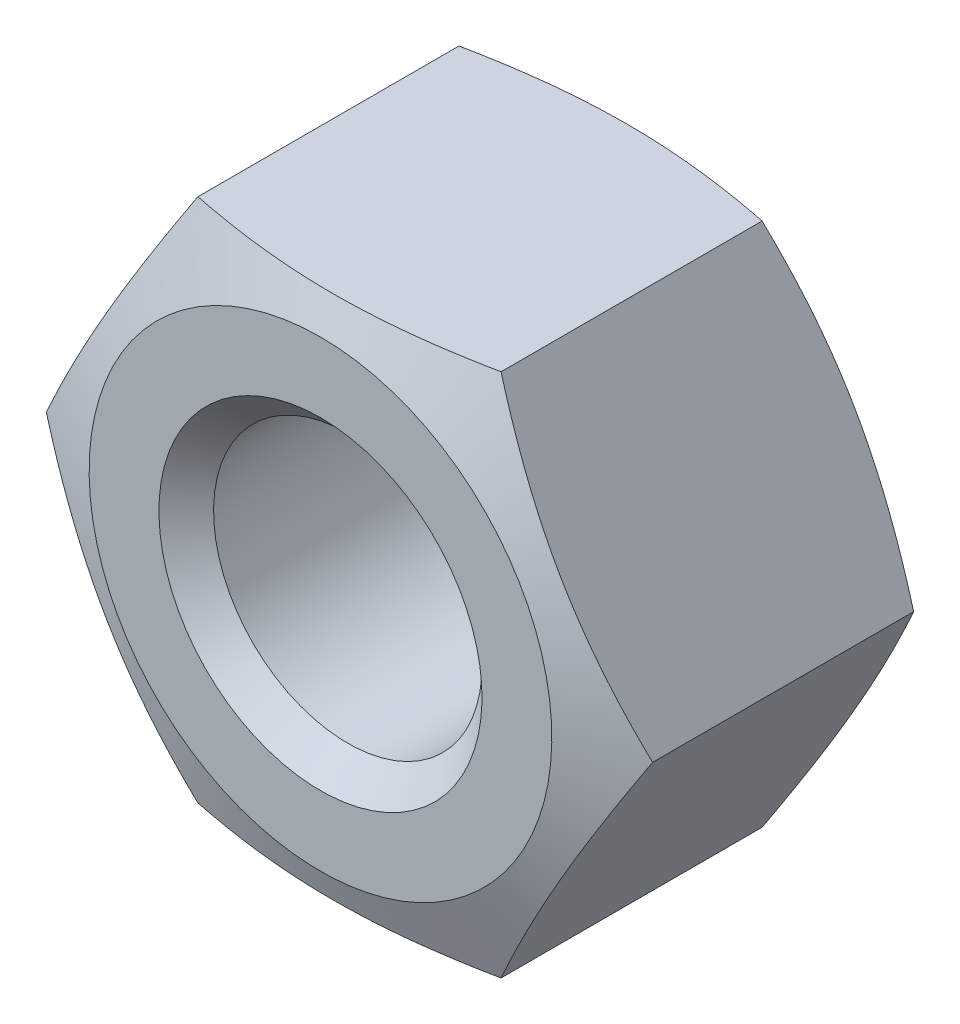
ISO-10303-21;
HEADER;
FILE_DESCRIPTION(('STEP AP214'),'2;1');
FILE_NAME('part.step','',(''),(''),'','','');
FILE_SCHEMA(('AUTOMOTIVE_DESIGN { 1 0 10303 214 1 1 1 1 }'));
ENDSEC;
DATA;
#1=APPLICATION_CONTEXT('core data for automotive mechanical design processes');
#2=APPLICATION_PROTOCOL_DEFINITION('international standard','automotive_design',2000,#1);
#3=PRODUCT_CONTEXT('',#1,'mechanical');
#4=PRODUCT('Part','Part','',(#3));
#5=PRODUCT_RELATED_PRODUCT_CATEGORY('part','',(#4));
#6=PRODUCT_DEFINITION_FORMATION('','',#4);
#7=PRODUCT_DEFINITION_CONTEXT('part definition',#1,'design');
#8=PRODUCT_DEFINITION('design','',#6,#7);
#9=PRODUCT_DEFINITION_SHAPE('','',#8);
#10=(LENGTH_UNIT() NAMED_UNIT(*) SI_UNIT(.MILLI.,.METRE.));
#11=(NAMED_UNIT(*) PLANE_ANGLE_UNIT() SI_UNIT($,.RADIAN.));
#12=(NAMED_UNIT(*) SI_UNIT($,.STERADIAN.) SOLID_ANGLE_UNIT());
#13=UNCERTAINTY_MEASURE_WITH_UNIT(LENGTH_MEASURE(1.E-05),#10,'distance_accuracy_value','');
#14=(GEOMETRIC_REPRESENTATION_CONTEXT(3) GLOBAL_UNCERTAINTY_ASSIGNED_CONTEXT((#13)) GLOBAL_UNIT_ASSIGNED_CONTEXT((#10,
#11,#12)) REPRESENTATION_CONTEXT('',''));
#15=CARTESIAN_POINT('',(0.,0.,0.));
#16=DIRECTION('',(0.,0.,1.));
#17=DIRECTION('',(1.,0.,0.));
#18=AXIS2_PLACEMENT_3D('',#15,#16,#17);
#19=CARTESIAN_POINT('',(7.50555000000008,-1.66533453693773E-13,7.90000000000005));
#20=DIRECTION('',(0.,0.,1.));
#21=DIRECTION('',(1.,0.,0.));
#22=AXIS2_PLACEMENT_3D('',#19,#20,#21);
#23=PLANE('',#22);
#24=CARTESIAN_POINT('',(0.,0.,7.90000000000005));
#25=DIRECTION('',(0.,0.,-1.));
#26=DIRECTION('',(0.,1.,0.));
#27=AXIS2_PLACEMENT_3D('',#24,#25,#26);
#28=CIRCLE('',#27,4.);
#29=CARTESIAN_POINT('',(0.,4.00000000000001,7.90000000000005));
#30=VERTEX_POINT('',#29);
#31=EDGE_CURVE('E207',#30,#30,#28,.T.);
#32=ORIENTED_EDGE('',*,*,#31,.T.);
#33=EDGE_LOOP('',(#32));
#34=FACE_BOUND('',#33,.T.);
#35=CARTESIAN_POINT('',(0.,0.,7.90000000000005));
#36=DIRECTION('',(0.,0.,-1.));
#37=DIRECTION('',(0.,1.,0.));
#38=AXIS2_PLACEMENT_3D('',#35,#36,#37);
#39=CIRCLE('',#38,5.72798762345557);
#40=CARTESIAN_POINT('',(0.,5.72798762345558,7.90000000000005));
#41=VERTEX_POINT('',#40);
#42=EDGE_CURVE('E210',#41,#41,#39,.T.);
#43=ORIENTED_EDGE('',*,*,#42,.F.);
#44=EDGE_LOOP('',(#43));
#45=FACE_BOUND('',#44,.T.);
#46=ADVANCED_FACE('F16',(#34,#45),#23,.T.);
#47=CARTESIAN_POINT('',(0.,0.,7.90000000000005));
#48=DIRECTION('',(0.,0.,1.));
#49=DIRECTION('',(0.,-1.,0.));
#50=AXIS2_PLACEMENT_3D('',#47,#48,#49);
#51=CONICAL_SURFACE('',#50,4.,0.785398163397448);
#52=CARTESIAN_POINT('',(0.,0.,7.22343750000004));
#53=DIRECTION('',(0.,0.,-1.));
#54=DIRECTION('',(0.,1.,0.));
#55=AXIS2_PLACEMENT_3D('',#52,#53,#54);
#56=CIRCLE('',#55,3.3234375);
#57=CARTESIAN_POINT('',(0.,3.3234375,7.22343750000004));
#58=VERTEX_POINT('',#57);
#59=EDGE_CURVE('E97',#58,#58,#56,.T.);
#60=ORIENTED_EDGE('',*,*,#59,.T.);
#61=EDGE_LOOP('',(#60));
#62=FACE_BOUND('',#61,.T.);
#63=ORIENTED_EDGE('',*,*,#31,.F.);
#64=EDGE_LOOP('',(#63));
#65=FACE_BOUND('',#64,.T.);
#66=ADVANCED_FACE('F140',(#62,#65),#51,.F.);
#67=CARTESIAN_POINT('',(0.,0.,0.));
#68=DIRECTION('',(0.,0.,-1.));
#69=DIRECTION('',(0.,1.,0.));
#70=AXIS2_PLACEMENT_3D('',#67,#68,#69);
#71=CYLINDRICAL_SURFACE('',#70,3.3234375);
#72=CARTESIAN_POINT('',(0.,0.,0.676562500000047));
#73=DIRECTION('',(0.,0.,-1.));
#74=DIRECTION('',(0.,1.,0.));
#75=AXIS2_PLACEMENT_3D('',#72,#73,#74);
#76=CIRCLE('',#75,3.3234375);
#77=CARTESIAN_POINT('',(0.,3.3234375,0.676562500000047));
#78=VERTEX_POINT('',#77);
#79=EDGE_CURVE('E94',#78,#78,#76,.T.);
#80=ORIENTED_EDGE('',*,*,#79,.T.);
#81=EDGE_LOOP('',(#80));
#82=FACE_BOUND('',#81,.T.);
#83=ORIENTED_EDGE('',*,*,#59,.F.);
#84=EDGE_LOOP('',(#83));
#85=FACE_BOUND('',#84,.T.);
#86=ADVANCED_FACE('F202',(#82,#85),#71,.F.);
#87=CARTESIAN_POINT('',(0.,0.,0.));
#88=DIRECTION('',(0.,0.,-1.));
#89=DIRECTION('',(0.,1.,0.));
#90=AXIS2_PLACEMENT_3D('',#87,#88,#89);
#91=CONICAL_SURFACE('',#90,4.,0.785398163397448);
#92=ORIENTED_EDGE('',*,*,#79,.F.);
#93=EDGE_LOOP('',(#92));
#94=FACE_BOUND('',#93,.T.);
#95=CARTESIAN_POINT('',(0.,0.,0.));
#96=DIRECTION('',(0.,0.,-1.));
#97=DIRECTION('',(0.,1.,0.));
#98=AXIS2_PLACEMENT_3D('',#95,#96,#97);
#99=CIRCLE('',#98,4.);
#100=CARTESIAN_POINT('',(0.,4.00000000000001,0.));
#101=VERTEX_POINT('',#100);
#102=EDGE_CURVE('E211',#101,#101,#99,.T.);
#103=ORIENTED_EDGE('',*,*,#102,.T.);
#104=EDGE_LOOP('',(#103));
#105=FACE_BOUND('',#104,.T.);
#106=ADVANCED_FACE('F138',(#94,#105),#91,.F.);
#107=CARTESIAN_POINT('',(0.,0.,7.18181818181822));
#108=DIRECTION('',(0.,0.,-1.));
#109=DIRECTION('',(0.,1.,0.));
#110=AXIS2_PLACEMENT_3D('',#107,#108,#109);
#111=CONICAL_SURFACE('',#110,7.50555,1.18682389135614);
#112=ORIENTED_EDGE('',*,*,#42,.T.);
#113=EDGE_LOOP('',(#112));
#114=FACE_BOUND('',#113,.T.);
#115=CARTESIAN_POINT('',(-9.90889392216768,-6.49999696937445,5.42631393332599));
#116=CARTESIAN_POINT('',(-9.61581993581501,-6.49999696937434,5.52529416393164));
#117=CARTESIAN_POINT('',(-9.32235536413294,-6.4999969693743,5.62313928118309));
#118=CARTESIAN_POINT('',(-8.73444298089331,-6.49999696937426,5.81592502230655));
#119=CARTESIAN_POINT('',(-8.43999507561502,-6.49999696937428,5.91086536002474));
#120=CARTESIAN_POINT('',(-7.84925559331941,-6.49999696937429,6.09741364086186));
#121=CARTESIAN_POINT('',(-7.55296127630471,-6.49999696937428,6.18901293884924));
#122=CARTESIAN_POINT('',(-6.95903252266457,-6.49999696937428,6.36774949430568));
#123=CARTESIAN_POINT('',(-6.66139811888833,-6.49999696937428,6.45488686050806));
#124=CARTESIAN_POINT('',(-6.06840594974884,-6.49999696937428,6.62248452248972));
#125=CARTESIAN_POINT('',(-5.77306858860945,-6.49999696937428,6.70301665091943));
#126=CARTESIAN_POINT('',(-5.18059575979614,-6.49999696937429,6.85725866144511));
#127=CARTESIAN_POINT('',(-4.88346023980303,-6.49999696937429,6.93096834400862));
#128=CARTESIAN_POINT('',(-4.28735076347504,-6.49999696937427,7.06979972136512));
#129=CARTESIAN_POINT('',(-3.98837794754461,-6.49999696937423,7.13492627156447));
#130=CARTESIAN_POINT('',(-3.38830805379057,-6.49999696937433,7.2545739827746));
#131=CARTESIAN_POINT('',(-3.08721113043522,-6.49999696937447,7.3090959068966));
#132=CARTESIAN_POINT('',(-2.54475973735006,-6.49999696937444,7.39541064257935));
#133=CARTESIAN_POINT('',(-2.30378398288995,-6.49999696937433,7.42957146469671));
#134=CARTESIAN_POINT('',(-1.82068769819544,-6.49999696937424,7.48859535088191));
#135=CARTESIAN_POINT('',(-1.57856719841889,-6.49999696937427,7.5134586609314));
#136=CARTESIAN_POINT('',(-1.09363632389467,-6.4999969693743,7.55290297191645));
#137=CARTESIAN_POINT('',(-0.850826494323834,-6.49999696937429,7.56749058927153));
#138=CARTESIAN_POINT('',(-0.364792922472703,-6.49999696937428,7.58577218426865));
#139=CARTESIAN_POINT('',(-0.12156918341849,-6.49999696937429,7.58946624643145));
#140=CARTESIAN_POINT('',(0.365975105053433,-6.49999696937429,7.58578157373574));
#141=CARTESIAN_POINT('',(0.610295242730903,-6.49999696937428,7.57834896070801));
#142=CARTESIAN_POINT('',(1.09836094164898,-6.49999696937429,7.55265365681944));
#143=CARTESIAN_POINT('',(1.34210649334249,-6.4999969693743,7.53439078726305));
#144=CARTESIAN_POINT('',(1.82877832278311,-6.49999696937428,7.48780053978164));
#145=CARTESIAN_POINT('',(2.07170397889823,-6.49999696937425,7.45946675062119));
#146=CARTESIAN_POINT('',(2.55632038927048,-6.49999696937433,7.39380121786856));
#147=CARTESIAN_POINT('',(2.79801114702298,-6.49999696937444,7.35646949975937));
#148=CARTESIAN_POINT('',(3.32056019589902,-6.49999696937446,7.26705270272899));
#149=CARTESIAN_POINT('',(3.6011730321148,-6.49999696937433,7.21354249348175));
#150=CARTESIAN_POINT('',(4.1605817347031,-6.49999696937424,7.09768026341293));
#151=CARTESIAN_POINT('',(4.43937737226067,-6.49999696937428,7.03532715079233));
#152=CARTESIAN_POINT('',(4.99538357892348,-6.4999969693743,6.90338209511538));
#153=CARTESIAN_POINT('',(5.272593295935,-6.49999696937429,6.83378658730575));
#154=CARTESIAN_POINT('',(5.8254602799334,-6.49999696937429,6.68875500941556));
#155=CARTESIAN_POINT('',(6.10111760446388,-6.49999696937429,6.61331915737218));
#156=CARTESIAN_POINT('',(6.65180906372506,-6.49999696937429,6.45751295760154));
#157=CARTESIAN_POINT('',(6.92683966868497,-6.49999696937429,6.37713018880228));
#158=CARTESIAN_POINT('',(7.47574069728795,-6.49999696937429,6.21250324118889));
#159=CARTESIAN_POINT('',(7.7496111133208,-6.49999696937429,6.12825903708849));
#160=CARTESIAN_POINT('',(8.29628429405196,-6.49999696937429,5.95664328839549));
#161=CARTESIAN_POINT('',(8.56908733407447,-6.49999696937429,5.86927261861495));
#162=CARTESIAN_POINT('',(9.11385015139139,-6.49999696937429,5.69193731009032));
#163=CARTESIAN_POINT('',(9.38580991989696,-6.49999696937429,5.60197264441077));
#164=CARTESIAN_POINT('',(10.1968967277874,-6.49999696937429,5.33012526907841));
#165=CARTESIAN_POINT('',(10.7349703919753,-6.49999696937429,5.14510073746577));
#166=CARTESIAN_POINT('',(11.8090841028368,-6.49999696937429,4.76914652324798));
#167=CARTESIAN_POINT('',(12.3451239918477,-6.49999696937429,4.5782163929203));
#168=CARTESIAN_POINT('',(13.4121207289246,-6.49999696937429,4.19335024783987));
#169=CARTESIAN_POINT('',(13.9430877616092,-6.49999696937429,3.99944242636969));
#170=CARTESIAN_POINT('',(14.7386313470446,-6.49999696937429,3.70622988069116));
#171=CARTESIAN_POINT('',(15.0036447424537,-6.49999696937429,3.60810680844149));
#172=CARTESIAN_POINT('',(15.533413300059,-6.49999696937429,3.41116883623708));
#173=CARTESIAN_POINT('',(15.7981684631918,-6.49999696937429,3.3123539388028));
#174=CARTESIAN_POINT('',(16.0628119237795,-6.49999696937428,3.21324060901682));
#175=B_SPLINE_CURVE_WITH_KNOTS('',3,(#115,#116,#117,#118,#119,#120,#121,#122,#123,#124,#125,
#126,#127,#128,#129,#130,#131,#132,#133,#134,#135,#136,#137,#138,#139,#140,#141,#142,#143,#144,
#145,#146,#147,#148,#149,#150,#151,#152,#153,#154,#155,#156,#157,#158,#159,#160,#161,#162,#163,
#164,#165,#166,#167,#168,#169,#170,#171,#172,#173,#174),.UNSPECIFIED.,.F.,.F.,(4,2,2,2,2,2,2,2,
2,2,2,2,2,2,2,2,2,2,2,2,2,2,2,2,2,2,2,2,2,4),(0.,0.928019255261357,1.8561296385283,
2.78649210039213,3.71683187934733,4.63512844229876,5.5534518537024,6.47125352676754,
7.38898913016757,8.11898850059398,8.84896855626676,9.57847815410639,10.3079820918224,
11.0410299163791,11.7740898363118,12.5076172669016,13.2411426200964,14.0979720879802,
14.9549074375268,15.8122665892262,16.669593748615,17.5291690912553,18.388750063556,
19.2480923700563,20.10744360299,21.8143772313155,23.5214405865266,25.2172257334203,
26.0650116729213,26.912794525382),.UNSPECIFIED.);
#176=CARTESIAN_POINT('',(-3.75277499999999,-6.49999696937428,7.18181818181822));
#177=VERTEX_POINT('',#176);
#178=CARTESIAN_POINT('',(3.75277500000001,-6.49999696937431,7.18181818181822));
#179=VERTEX_POINT('',#178);
#180=EDGE_CURVE('E77',#177,#179,#175,.T.);
#181=ORIENTED_EDGE('',*,*,#180,.T.);
#182=CARTESIAN_POINT('',(3.7527748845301,-6.49999716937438,7.18181813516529));
#183=CARTESIAN_POINT('',(3.88388671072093,-6.27290482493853,7.23479379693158));
#184=CARTESIAN_POINT('',(4.01543128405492,-6.04506294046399,7.28377831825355));
#185=CARTESIAN_POINT('',(4.27939025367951,-5.58787259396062,7.37225953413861));
#186=CARTESIAN_POINT('',(4.41180511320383,-5.35852332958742,7.4117506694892));
#187=CARTESIAN_POINT('',(4.67731617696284,-4.89864467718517,7.47966399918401));
#188=CARTESIAN_POINT('',(4.81041216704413,-4.66811566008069,7.50808947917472));
#189=CARTESIAN_POINT('',(5.07709854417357,-4.20620130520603,7.55255421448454));
#190=CARTESIAN_POINT('',(5.21068881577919,-3.97481616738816,7.56859619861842));
#191=CARTESIAN_POINT('',(5.4758356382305,-3.51556839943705,7.58729635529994));
#192=CARTESIAN_POINT('',(5.60738820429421,-3.28771267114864,7.59017716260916));
#193=CARTESIAN_POINT('',(5.87041559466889,-2.83213586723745,7.58300544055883));
#194=CARTESIAN_POINT('',(6.00189041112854,-2.60441480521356,7.57295177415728));
#195=CARTESIAN_POINT('',(6.26436520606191,-2.1497951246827,7.54045156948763));
#196=CARTESIAN_POINT('',(6.3953654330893,-1.92289607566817,7.5180129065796));
#197=CARTESIAN_POINT('',(6.65674042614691,-1.47018130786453,7.46183013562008));
#198=CARTESIAN_POINT('',(6.78711525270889,-1.24436548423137,7.42808714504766));
#199=CARTESIAN_POINT('',(6.96628658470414,-0.934031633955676,7.37474923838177));
#200=CARTESIAN_POINT('',(7.01540954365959,-0.848948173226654,7.3594003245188));
#201=CARTESIAN_POINT('',(7.11353952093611,-0.678982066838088,7.32736591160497));
#202=CARTESIAN_POINT('',(7.16254655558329,-0.594099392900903,7.31068061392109));
#203=CARTESIAN_POINT('',(7.26061650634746,-0.424237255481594,7.27599122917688));
#204=CARTESIAN_POINT('',(7.30967903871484,-0.339258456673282,7.2579828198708));
#205=CARTESIAN_POINT('',(7.4076966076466,-0.169487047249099,7.2207743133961));
#206=CARTESIAN_POINT('',(7.45665163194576,-0.0846944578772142,7.20157408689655));
#207=CARTESIAN_POINT('',(7.50555011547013,1.99999988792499E-07,7.18181813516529));
#208=B_SPLINE_CURVE_WITH_KNOTS('',3,(#182,#183,#184,#185,#186,#187,#188,#189,#190,#191,#192,
#193,#194,#195,#196,#197,#198,#199,#200,#201,#202,#203,#204,#205,#206,#207),.UNSPECIFIED.,.F.,
.F.,(4,2,2,2,2,2,2,2,2,2,2,2,4),(0.,0.80262018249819,1.6057092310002,2.40855964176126,
3.21123308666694,4.00027695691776,4.78939019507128,5.57800222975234,6.36653632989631,
6.66484369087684,6.96310618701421,7.26239050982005,7.56170736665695),.UNSPECIFIED.);
#209=CARTESIAN_POINT('',(7.50555000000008,-1.66533453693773E-13,7.18181818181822));
#210=VERTEX_POINT('',#209);
#211=EDGE_CURVE('E162',#179,#210,#208,.T.);
#212=ORIENTED_EDGE('',*,*,#211,.T.);
#213=CARTESIAN_POINT('',(7.50555011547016,-2.00000155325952E-07,7.18181813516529));
#214=CARTESIAN_POINT('',(7.37443828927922,0.227092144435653,7.23479379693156));
#215=CARTESIAN_POINT('',(7.24289371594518,0.454934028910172,7.28377831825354));
#216=CARTESIAN_POINT('',(6.97893474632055,0.912124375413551,7.37225953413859));
#217=CARTESIAN_POINT('',(6.84651988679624,1.14147363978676,7.4117506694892));
#218=CARTESIAN_POINT('',(6.58100882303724,1.60135229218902,7.47966399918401));
#219=CARTESIAN_POINT('',(6.44791283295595,1.83188130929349,7.50808947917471));
#220=CARTESIAN_POINT('',(6.18122645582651,2.29379566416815,7.55255421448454));
#221=CARTESIAN_POINT('',(6.04763618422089,2.52518080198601,7.56859619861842));
#222=CARTESIAN_POINT('',(5.78248936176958,2.98442856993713,7.58729635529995));
#223=CARTESIAN_POINT('',(5.65093679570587,3.21228429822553,7.59017716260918));
#224=CARTESIAN_POINT('',(5.38790940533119,3.66786110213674,7.58300544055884));
#225=CARTESIAN_POINT('',(5.25643458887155,3.89558216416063,7.57295177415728));
#226=CARTESIAN_POINT('',(4.99395979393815,4.35020184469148,7.54045156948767));
#227=CARTESIAN_POINT('',(4.86295956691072,4.577100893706,7.51801290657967));
#228=CARTESIAN_POINT('',(4.60158457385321,5.0298156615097,7.46183013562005));
#229=CARTESIAN_POINT('',(4.47120974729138,5.25563148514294,7.42808714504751));
#230=CARTESIAN_POINT('',(4.292038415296,5.56596533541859,7.37474923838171));
#231=CARTESIAN_POINT('',(4.24291545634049,5.65104879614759,7.3594003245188));
#232=CARTESIAN_POINT('',(4.14478547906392,5.82101490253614,7.32736591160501));
#233=CARTESIAN_POINT('',(4.09577844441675,5.90589757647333,7.31068061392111));
#234=CARTESIAN_POINT('',(3.99770849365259,6.07575971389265,7.2759912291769));
#235=CARTESIAN_POINT('',(3.9486459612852,6.16073851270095,7.25798281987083));
#236=CARTESIAN_POINT('',(3.85062839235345,6.33050992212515,7.22077431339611));
#237=CARTESIAN_POINT('',(3.80167336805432,6.41530251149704,7.20157408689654));
#238=CARTESIAN_POINT('',(3.75277488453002,6.49999716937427,7.18181813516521));
#239=B_SPLINE_CURVE_WITH_KNOTS('',3,(#213,#214,#215,#216,#217,#218,#219,#220,#221,#222,#223,
#224,#225,#226,#227,#228,#229,#230,#231,#232,#233,#234,#235,#236,#237,#238),.UNSPECIFIED.,.F.,
.F.,(4,2,2,2,2,2,2,2,2,2,2,2,4),(0.,0.802620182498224,1.60570923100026,2.40855964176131,
3.21123308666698,4.00027695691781,4.78939019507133,5.57800222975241,6.36653632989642,
6.66484369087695,6.96310618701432,7.26239050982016,7.56170736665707),.UNSPECIFIED.);
#240=CARTESIAN_POINT('',(3.75277500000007,6.49999696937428,7.18181818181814));
#241=VERTEX_POINT('',#240);
#242=EDGE_CURVE('E39',#210,#241,#239,.T.);
#243=ORIENTED_EDGE('',*,*,#242,.T.);
#244=CARTESIAN_POINT('',(-9.9088939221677,6.49999696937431,5.4263139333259));
#245=CARTESIAN_POINT('',(-9.61581993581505,6.49999696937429,5.5252941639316));
#246=CARTESIAN_POINT('',(-9.32235536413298,6.49999696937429,5.62313928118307));
#247=CARTESIAN_POINT('',(-8.73444298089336,6.49999696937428,5.81592502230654));
#248=CARTESIAN_POINT('',(-8.43999507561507,6.49999696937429,5.91086536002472));
#249=CARTESIAN_POINT('',(-7.84925559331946,6.49999696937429,6.09741364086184));
#250=CARTESIAN_POINT('',(-7.55296127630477,6.49999696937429,6.18901293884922));
#251=CARTESIAN_POINT('',(-6.95903252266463,6.49999696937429,6.36774949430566));
#252=CARTESIAN_POINT('',(-6.66139811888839,6.49999696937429,6.45488686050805));
#253=CARTESIAN_POINT('',(-6.06840594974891,6.49999696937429,6.6224845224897));
#254=CARTESIAN_POINT('',(-5.77306858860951,6.49999696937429,6.70301665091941));
#255=CARTESIAN_POINT('',(-5.18059575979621,6.49999696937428,6.85725866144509));
#256=CARTESIAN_POINT('',(-4.8834602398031,6.49999696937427,6.93096834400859));
#257=CARTESIAN_POINT('',(-4.28735076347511,6.4999969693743,7.06979972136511));
#258=CARTESIAN_POINT('',(-3.98837794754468,6.49999696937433,7.13492627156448));
#259=CARTESIAN_POINT('',(-3.38830805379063,6.49999696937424,7.25457398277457));
#260=CARTESIAN_POINT('',(-3.08721113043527,6.49999696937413,7.30909590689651));
#261=CARTESIAN_POINT('',(-2.54475973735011,6.49999696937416,7.39541064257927));
#262=CARTESIAN_POINT('',(-2.30378398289,6.49999696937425,7.42957146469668));
#263=CARTESIAN_POINT('',(-1.82068769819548,6.49999696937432,7.48859535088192));
#264=CARTESIAN_POINT('',(-1.57856719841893,6.49999696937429,7.5134586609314));
#265=CARTESIAN_POINT('',(-1.0936363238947,6.49999696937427,7.55290297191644));
#266=CARTESIAN_POINT('',(-0.850826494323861,6.49999696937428,7.56749058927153));
#267=CARTESIAN_POINT('',(-0.364792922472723,6.49999696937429,7.58577218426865));
#268=CARTESIAN_POINT('',(-0.121569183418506,6.49999696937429,7.58946624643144));
#269=CARTESIAN_POINT('',(0.365975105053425,6.49999696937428,7.58578157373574));
#270=CARTESIAN_POINT('',(0.610295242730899,6.49999696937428,7.57834896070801));
#271=CARTESIAN_POINT('',(1.09836094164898,6.49999696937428,7.55265365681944));
#272=CARTESIAN_POINT('',(1.34210649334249,6.49999696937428,7.53439078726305));
#273=CARTESIAN_POINT('',(1.82877832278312,6.49999696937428,7.48780053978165));
#274=CARTESIAN_POINT('',(2.07170397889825,6.49999696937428,7.45946675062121));
#275=CARTESIAN_POINT('',(2.55632038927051,6.49999696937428,7.39380121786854));
#276=CARTESIAN_POINT('',(2.79801114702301,6.49999696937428,7.35646949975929));
#277=CARTESIAN_POINT('',(3.32056019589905,6.49999696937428,7.2670527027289));
#278=CARTESIAN_POINT('',(3.60117303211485,6.49999696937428,7.21354249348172));
#279=CARTESIAN_POINT('',(4.16058173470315,6.49999696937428,7.09768026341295));
#280=CARTESIAN_POINT('',(4.43937737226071,6.49999696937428,7.03532715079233));
#281=CARTESIAN_POINT('',(4.99538357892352,6.49999696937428,6.90338209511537));
#282=CARTESIAN_POINT('',(5.27259329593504,6.49999696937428,6.83378658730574));
#283=CARTESIAN_POINT('',(5.82546027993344,6.49999696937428,6.68875500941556));
#284=CARTESIAN_POINT('',(6.10111760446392,6.49999696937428,6.61331915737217));
#285=CARTESIAN_POINT('',(6.6518090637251,6.49999696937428,6.45751295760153));
#286=CARTESIAN_POINT('',(6.926839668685,6.49999696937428,6.37713018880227));
#287=CARTESIAN_POINT('',(7.47574069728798,6.49999696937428,6.21250324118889));
#288=CARTESIAN_POINT('',(7.74961111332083,6.49999696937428,6.12825903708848));
#289=CARTESIAN_POINT('',(8.29628429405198,6.49999696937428,5.95664328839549));
#290=CARTESIAN_POINT('',(8.5690873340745,6.49999696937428,5.86927261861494));
#291=CARTESIAN_POINT('',(9.11385015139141,6.49999696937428,5.69193731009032));
#292=CARTESIAN_POINT('',(9.38580991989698,6.49999696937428,5.60197264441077));
#293=CARTESIAN_POINT('',(10.1968967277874,6.49999696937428,5.33012526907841));
#294=CARTESIAN_POINT('',(10.7349703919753,6.49999696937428,5.14510073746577));
#295=CARTESIAN_POINT('',(11.8090841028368,6.49999696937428,4.76914652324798));
#296=CARTESIAN_POINT('',(12.3451239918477,6.49999696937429,4.57821639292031));
#297=CARTESIAN_POINT('',(13.4121207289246,6.49999696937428,4.19335024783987));
#298=CARTESIAN_POINT('',(13.9430877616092,6.49999696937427,3.99944242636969));
#299=CARTESIAN_POINT('',(14.7386313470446,6.49999696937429,3.70622988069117));
#300=CARTESIAN_POINT('',(15.0036447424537,6.4999969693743,3.6081068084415));
#301=CARTESIAN_POINT('',(15.5334133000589,6.49999696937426,3.41116883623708));
#302=CARTESIAN_POINT('',(15.7981684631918,6.49999696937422,3.31235393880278));
#303=CARTESIAN_POINT('',(16.0628119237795,6.49999696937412,3.21324060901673));
#304=B_SPLINE_CURVE_WITH_KNOTS('',3,(#244,#245,#246,#247,#248,#249,#250,#251,#252,#253,#254,
#255,#256,#257,#258,#259,#260,#261,#262,#263,#264,#265,#266,#267,#268,#269,#270,#271,#272,#273,
#274,#275,#276,#277,#278,#279,#280,#281,#282,#283,#284,#285,#286,#287,#288,#289,#290,#291,#292,
#293,#294,#295,#296,#297,#298,#299,#300,#301,#302,#303),.UNSPECIFIED.,.F.,.F.,(4,2,2,2,2,2,2,2,
2,2,2,2,2,2,2,2,2,2,2,2,2,2,2,2,2,2,2,2,2,4),(0.,0.928019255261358,1.85612963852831,
2.78649210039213,3.71683187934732,4.63512844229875,5.55345185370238,6.47125352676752,
7.38898913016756,8.11898850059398,8.84896855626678,9.57847815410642,10.3079820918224,
11.0410299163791,11.7740898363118,12.5076172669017,13.2411426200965,14.0979720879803,
14.9549074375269,15.8122665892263,16.6695937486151,17.5291690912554,18.3887500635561,
19.2480923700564,20.1074436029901,21.8143772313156,23.5214405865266,25.2172257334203,
26.0650116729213,26.9127945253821),.UNSPECIFIED.);
#305=CARTESIAN_POINT('',(-3.75277499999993,6.49999696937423,7.18181818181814));
#306=VERTEX_POINT('',#305);
#307=EDGE_CURVE('E153',#241,#306,#304,.F.);
#308=ORIENTED_EDGE('',*,*,#307,.T.);
#309=CARTESIAN_POINT('',(-3.75277488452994,6.4999971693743,7.18181813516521));
#310=CARTESIAN_POINT('',(-3.8838867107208,6.27290482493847,7.23479379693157));
#311=CARTESIAN_POINT('',(-4.01543128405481,6.04506294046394,7.28377831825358));
#312=CARTESIAN_POINT('',(-4.27939025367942,5.58787259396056,7.37225953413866));
#313=CARTESIAN_POINT('',(-4.41180511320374,5.35852332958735,7.41175066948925));
#314=CARTESIAN_POINT('',(-4.67731617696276,4.89864467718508,7.47966399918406));
#315=CARTESIAN_POINT('',(-4.81041216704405,4.6681156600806,7.50808947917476));
#316=CARTESIAN_POINT('',(-5.0770985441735,4.20620130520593,7.55255421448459));
#317=CARTESIAN_POINT('',(-5.21068881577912,3.97481616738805,7.56859619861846));
#318=CARTESIAN_POINT('',(-5.47583563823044,3.51556839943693,7.58729635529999));
#319=CARTESIAN_POINT('',(-5.60738820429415,3.28771267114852,7.59017716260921));
#320=CARTESIAN_POINT('',(-5.87041559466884,2.83213586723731,7.58300544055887));
#321=CARTESIAN_POINT('',(-6.00189041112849,2.60441480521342,7.57295177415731));
#322=CARTESIAN_POINT('',(-6.26436520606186,2.14979512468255,7.54045156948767));
#323=CARTESIAN_POINT('',(-6.39536543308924,1.922896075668,7.51801290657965));
#324=CARTESIAN_POINT('',(-6.65674042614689,1.47018130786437,7.46183013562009));
#325=CARTESIAN_POINT('',(-6.78711525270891,1.24436548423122,7.42808714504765));
#326=CARTESIAN_POINT('',(-6.96628658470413,0.93403163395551,7.37474923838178));
#327=CARTESIAN_POINT('',(-7.01540954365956,0.848948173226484,7.35940032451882));
#328=CARTESIAN_POINT('',(-7.11353952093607,0.67898206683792,7.327365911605));
#329=CARTESIAN_POINT('',(-7.16254655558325,0.594099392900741,7.31068061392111));
#330=CARTESIAN_POINT('',(-7.26061650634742,0.424237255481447,7.27599122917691));
#331=CARTESIAN_POINT('',(-7.3096790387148,0.339258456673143,7.25798281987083));
#332=CARTESIAN_POINT('',(-7.40769660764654,0.16948704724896,7.22077431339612));
#333=CARTESIAN_POINT('',(-7.45665163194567,0.0846944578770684,7.20157408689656));
#334=CARTESIAN_POINT('',(-7.50555011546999,-2.00000155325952E-07,7.18181813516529));
#335=B_SPLINE_CURVE_WITH_KNOTS('',3,(#309,#310,#311,#312,#313,#314,#315,#316,#317,#318,#319,
#320,#321,#322,#323,#324,#325,#326,#327,#328,#329,#330,#331,#332,#333,#334),.UNSPECIFIED.,.F.,
.F.,(4,2,2,2,2,2,2,2,2,2,2,2,4),(0.,0.802620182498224,1.60570923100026,2.40855964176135,
3.21123308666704,4.00027695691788,4.78939019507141,5.5780022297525,6.3665363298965,
6.664843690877,6.96310618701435,7.26239050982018,7.56170736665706),.UNSPECIFIED.);
#336=CARTESIAN_POINT('',(-7.50554999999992,0.,7.18181818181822));
#337=VERTEX_POINT('',#336);
#338=EDGE_CURVE('E148',#306,#337,#335,.T.);
#339=ORIENTED_EDGE('',*,*,#338,.T.);
#340=CARTESIAN_POINT('',(-7.50555011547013,1.99999988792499E-07,7.18181813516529));
#341=CARTESIAN_POINT('',(-7.37443828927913,-0.227092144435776,7.2347937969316));
#342=CARTESIAN_POINT('',(-7.24289371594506,-0.454934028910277,7.28377831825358));
#343=CARTESIAN_POINT('',(-6.97893474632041,-0.912124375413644,7.37225953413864));
#344=CARTESIAN_POINT('',(-6.84651988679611,-1.14147363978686,7.41175066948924));
#345=CARTESIAN_POINT('',(-6.5810088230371,-1.60135229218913,7.47966399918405));
#346=CARTESIAN_POINT('',(-6.4479128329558,-1.83188130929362,7.50808947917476));
#347=CARTESIAN_POINT('',(-6.18122645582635,-2.2937956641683,7.55255421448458));
#348=CARTESIAN_POINT('',(-6.04763618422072,-2.52518080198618,7.56859619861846));
#349=CARTESIAN_POINT('',(-5.7824893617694,-2.98442856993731,7.58729635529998));
#350=CARTESIAN_POINT('',(-5.65093679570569,-3.21228429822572,7.5901771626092));
#351=CARTESIAN_POINT('',(-5.387909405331,-3.66786110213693,7.58300544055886));
#352=CARTESIAN_POINT('',(-5.25643458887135,-3.89558216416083,7.5729517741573));
#353=CARTESIAN_POINT('',(-4.99395979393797,-4.35020184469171,7.54045156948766));
#354=CARTESIAN_POINT('',(-4.86295956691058,-4.57710089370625,7.51801290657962));
#355=CARTESIAN_POINT('',(-4.60158457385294,-5.0298156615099,7.46183013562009));
#356=CARTESIAN_POINT('',(-4.47120974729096,-5.25563148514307,7.42808714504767));
#357=CARTESIAN_POINT('',(-4.29203841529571,-5.56596533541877,7.37474923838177));
#358=CARTESIAN_POINT('',(-4.24291545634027,-5.65104879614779,7.3594003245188));
#359=CARTESIAN_POINT('',(-4.14478547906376,-5.82101490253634,7.32736591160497));
#360=CARTESIAN_POINT('',(-4.09577844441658,-5.90589757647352,7.31068061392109));
#361=CARTESIAN_POINT('',(-3.99770849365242,-6.07575971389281,7.27599122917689));
#362=CARTESIAN_POINT('',(-3.94864596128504,-6.16073851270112,7.25798281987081));
#363=CARTESIAN_POINT('',(-3.85062839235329,-6.33050992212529,7.2207743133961));
#364=CARTESIAN_POINT('',(-3.80167336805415,-6.41530251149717,7.20157408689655));
#365=CARTESIAN_POINT('',(-3.7527748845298,-6.49999716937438,7.18181813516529));
#366=B_SPLINE_CURVE_WITH_KNOTS('',3,(#340,#341,#342,#343,#344,#345,#346,#347,#348,#349,#350,
#351,#352,#353,#354,#355,#356,#357,#358,#359,#360,#361,#362,#363,#364,#365),.UNSPECIFIED.,.F.,
.F.,(4,2,2,2,2,2,2,2,2,2,2,2,4),(0.,0.802620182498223,1.60570923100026,2.40855964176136,
3.21123308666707,4.00027695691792,4.78939019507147,5.57800222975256,6.36653632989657,
6.66484369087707,6.96310618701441,7.26239050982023,7.56170736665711),.UNSPECIFIED.);
#367=EDGE_CURVE('E125',#337,#177,#366,.T.);
#368=ORIENTED_EDGE('',*,*,#367,.T.);
#369=EDGE_LOOP('',(#181,#212,#243,#308,#339,#368));
#370=FACE_BOUND('',#369,.T.);
#371=ADVANCED_FACE('F134',(#114,#370),#111,.T.);
#372=CARTESIAN_POINT('',(3.75277500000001,-6.49999696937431,7.90000000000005));
#373=DIRECTION('',(-0.86602540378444,0.5,0.));
#374=DIRECTION('',(-0.5,-0.86602540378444,0.));
#375=AXIS2_PLACEMENT_3D('',#372,#373,#374);
#376=PLANE('',#375);
#377=ORIENTED_EDGE('',*,*,#211,.F.);
#378=DIRECTION('',(0.,0.,-1.));
#379=VECTOR('',#378,1.);
#380=CARTESIAN_POINT('',(3.75277500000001,-6.49999696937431,7.90000000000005));
#381=LINE('',#380,#379);
#382=CARTESIAN_POINT('',(3.75277500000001,-6.49999696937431,0.718181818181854));
#383=VERTEX_POINT('',#382);
#384=EDGE_CURVE('E81',#179,#383,#381,.T.);
#385=ORIENTED_EDGE('',*,*,#384,.T.);
#386=CARTESIAN_POINT('',(7.50555011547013,1.99999988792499E-07,0.718181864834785));
#387=CARTESIAN_POINT('',(7.37443828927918,-0.227092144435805,0.665206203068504));
#388=CARTESIAN_POINT('',(7.24289371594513,-0.454934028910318,0.616221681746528));
#389=CARTESIAN_POINT('',(6.9789347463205,-0.91212437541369,0.527740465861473));
#390=CARTESIAN_POINT('',(6.84651988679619,-1.1414736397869,0.488249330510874));
#391=CARTESIAN_POINT('',(6.58100882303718,-1.60135229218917,0.420336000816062));
#392=CARTESIAN_POINT('',(6.44791283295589,-1.83188130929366,0.391910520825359));
#393=CARTESIAN_POINT('',(6.18122645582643,-2.29379566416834,0.347445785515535));
#394=CARTESIAN_POINT('',(6.04763618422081,-2.52518080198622,0.33140380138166));
#395=CARTESIAN_POINT('',(5.78248936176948,-2.98442856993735,0.312703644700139));
#396=CARTESIAN_POINT('',(5.65093679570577,-3.21228429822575,0.309822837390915));
#397=CARTESIAN_POINT('',(5.38790940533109,-3.66786110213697,0.316994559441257));
#398=CARTESIAN_POINT('',(5.25643458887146,-3.89558216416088,0.327048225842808));
#399=CARTESIAN_POINT('',(4.99395979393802,-4.35020184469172,0.359548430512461));
#400=CARTESIAN_POINT('',(4.86295956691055,-4.57710089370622,0.381987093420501));
#401=CARTESIAN_POINT('',(4.60158457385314,-5.02981566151,0.438169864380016));
#402=CARTESIAN_POINT('',(4.47120974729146,-5.25563148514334,0.471912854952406));
#403=CARTESIAN_POINT('',(4.29203841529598,-5.56596533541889,0.525250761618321));
#404=CARTESIAN_POINT('',(4.24291545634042,-5.65104879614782,0.540599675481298));
#405=CARTESIAN_POINT('',(4.14478547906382,-5.8210149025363,0.572634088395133));
#406=CARTESIAN_POINT('',(4.09577844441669,-5.90589757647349,0.589319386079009));
#407=CARTESIAN_POINT('',(3.99770849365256,-6.07575971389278,0.624008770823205));
#408=CARTESIAN_POINT('',(3.94864596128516,-6.16073851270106,0.642017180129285));
#409=CARTESIAN_POINT('',(3.85062839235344,-6.33050992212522,0.679225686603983));
#410=CARTESIAN_POINT('',(3.80167336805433,-6.41530251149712,0.698425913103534));
#411=CARTESIAN_POINT('',(3.7527748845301,-6.49999716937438,0.718181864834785));
#412=B_SPLINE_CURVE_WITH_KNOTS('',3,(#386,#387,#388,#389,#390,#391,#392,#393,#394,#395,#396,
#397,#398,#399,#400,#401,#402,#403,#404,#405,#406,#407,#408,#409,#410,#411),.UNSPECIFIED.,.F.,
.F.,(4,2,2,2,2,2,2,2,2,2,2,2,4),(0.,0.802620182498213,1.60570923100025,2.40855964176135,
3.21123308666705,4.0002769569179,4.78939019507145,5.57800222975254,6.36653632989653,
6.664843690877,6.96310618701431,7.2623905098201,7.56170736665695),.UNSPECIFIED.);
#413=CARTESIAN_POINT('',(7.50555000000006,-1.66533453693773E-13,0.718181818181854));
#414=VERTEX_POINT('',#413);
#415=EDGE_CURVE('E32',#414,#383,#412,.T.);
#416=ORIENTED_EDGE('',*,*,#415,.F.);
#417=DIRECTION('',(0.,0.,-1.));
#418=VECTOR('',#417,1.);
#419=CARTESIAN_POINT('',(7.50555000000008,-1.66533453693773E-13,7.90000000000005));
#420=LINE('',#419,#418);
#421=EDGE_CURVE('E25',#210,#414,#420,.T.);
#422=ORIENTED_EDGE('',*,*,#421,.F.);
#423=EDGE_LOOP('',(#377,#385,#416,#422));
#424=FACE_BOUND('',#423,.T.);
#425=ADVANCED_FACE('F18',(#424),#376,.F.);
#426=CARTESIAN_POINT('',(7.50555000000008,-1.66533453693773E-13,7.90000000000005));
#427=DIRECTION('',(-0.86602540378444,-0.5,0.));
#428=DIRECTION('',(0.5,-0.86602540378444,0.));
#429=AXIS2_PLACEMENT_3D('',#426,#427,#428);
#430=PLANE('',#429);
#431=ORIENTED_EDGE('',*,*,#242,.F.);
#432=ORIENTED_EDGE('',*,*,#421,.T.);
#433=CARTESIAN_POINT('',(3.75277488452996,6.49999716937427,0.718181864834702));
#434=CARTESIAN_POINT('',(3.88388671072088,6.27290482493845,0.665206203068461));
#435=CARTESIAN_POINT('',(4.01543128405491,6.04506294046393,0.616221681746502));
#436=CARTESIAN_POINT('',(4.27939025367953,5.58787259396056,0.527740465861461));
#437=CARTESIAN_POINT('',(4.41180511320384,5.35852332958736,0.488249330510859));
#438=CARTESIAN_POINT('',(4.67731617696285,4.89864467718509,0.420336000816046));
#439=CARTESIAN_POINT('',(4.81041216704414,4.66811566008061,0.391910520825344));
#440=CARTESIAN_POINT('',(5.07709854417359,4.20620130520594,0.347445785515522));
#441=CARTESIAN_POINT('',(5.21068881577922,3.97481616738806,0.331403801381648));
#442=CARTESIAN_POINT('',(5.47583563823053,3.51556839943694,0.312703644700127));
#443=CARTESIAN_POINT('',(5.60738820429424,3.28771267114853,0.309822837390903));
#444=CARTESIAN_POINT('',(5.87041559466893,2.83213586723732,0.316994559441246));
#445=CARTESIAN_POINT('',(6.00189041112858,2.60441480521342,0.327048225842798));
#446=CARTESIAN_POINT('',(6.26436520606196,2.14979512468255,0.359548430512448));
#447=CARTESIAN_POINT('',(6.39536543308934,1.92289607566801,0.381987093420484));
#448=CARTESIAN_POINT('',(6.65674042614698,1.47018130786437,0.438169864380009));
#449=CARTESIAN_POINT('',(6.78711525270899,1.24436548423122,0.471912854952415));
#450=CARTESIAN_POINT('',(6.96628658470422,0.93403163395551,0.52525076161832));
#451=CARTESIAN_POINT('',(7.01540954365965,0.848948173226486,0.540599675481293));
#452=CARTESIAN_POINT('',(7.11353952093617,0.678982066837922,0.572634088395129));
#453=CARTESIAN_POINT('',(7.16254655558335,0.594099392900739,0.589319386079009));
#454=CARTESIAN_POINT('',(7.26061650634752,0.424237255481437,0.624008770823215));
#455=CARTESIAN_POINT('',(7.3096790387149,0.339258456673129,0.642017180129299));
#456=CARTESIAN_POINT('',(7.40769660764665,0.169487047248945,0.679225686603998));
#457=CARTESIAN_POINT('',(7.4566516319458,0.0846944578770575,0.698425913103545));
#458=CARTESIAN_POINT('',(7.50555011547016,-2.00000155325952E-07,0.718181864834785));
#459=B_SPLINE_CURVE_WITH_KNOTS('',3,(#433,#434,#435,#436,#437,#438,#439,#440,#441,#442,#443,
#444,#445,#446,#447,#448,#449,#450,#451,#452,#453,#454,#455,#456,#457,#458),.UNSPECIFIED.,.F.,
.F.,(4,2,2,2,2,2,2,2,2,2,2,2,4),(0.,0.802620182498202,1.60570923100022,2.40855964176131,
3.211233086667,4.00027695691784,4.78939019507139,5.57800222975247,6.36653632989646,
6.66484369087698,6.96310618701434,7.26239050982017,7.56170736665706),.UNSPECIFIED.);
#460=CARTESIAN_POINT('',(3.75277500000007,6.49999696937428,0.718181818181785));
#461=VERTEX_POINT('',#460);
#462=EDGE_CURVE('E173',#461,#414,#459,.T.);
#463=ORIENTED_EDGE('',*,*,#462,.F.);
#464=DIRECTION('',(0.,0.,-1.));
#465=VECTOR('',#464,1.);
#466=CARTESIAN_POINT('',(3.75277500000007,6.49999696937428,7.89999999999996));
#467=LINE('',#466,#465);
#468=EDGE_CURVE('E300',#241,#461,#467,.T.);
#469=ORIENTED_EDGE('',*,*,#468,.F.);
#470=EDGE_LOOP('',(#431,#432,#463,#469));
#471=FACE_BOUND('',#470,.T.);
#472=ADVANCED_FACE('F167',(#471),#430,.F.);
#473=CARTESIAN_POINT('',(3.75277500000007,6.49999696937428,7.89999999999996));
#474=DIRECTION('',(0.,-1.,0.));
#475=DIRECTION('',(1.,0.,0.));
#476=AXIS2_PLACEMENT_3D('',#473,#474,#475);
#477=PLANE('',#476);
#478=ORIENTED_EDGE('',*,*,#307,.F.);
#479=ORIENTED_EDGE('',*,*,#468,.T.);
#480=CARTESIAN_POINT('',(-9.9088939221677,6.49999696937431,2.47368606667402));
#481=CARTESIAN_POINT('',(-9.61581993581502,6.49999696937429,2.37470583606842));
#482=CARTESIAN_POINT('',(-9.32235536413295,6.49999696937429,2.27686071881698));
#483=CARTESIAN_POINT('',(-8.73444298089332,6.49999696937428,2.08407497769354));
#484=CARTESIAN_POINT('',(-8.43999507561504,6.49999696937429,1.98913463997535));
#485=CARTESIAN_POINT('',(-7.84925559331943,6.49999696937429,1.80258635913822));
#486=CARTESIAN_POINT('',(-7.55296127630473,6.49999696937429,1.71098706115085));
#487=CARTESIAN_POINT('',(-6.95903252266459,6.49999696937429,1.53225050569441));
#488=CARTESIAN_POINT('',(-6.66139811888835,6.49999696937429,1.44511313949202));
#489=CARTESIAN_POINT('',(-6.06840594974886,6.49999696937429,1.27751547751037));
#490=CARTESIAN_POINT('',(-5.77306858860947,6.49999696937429,1.19698334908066));
#491=CARTESIAN_POINT('',(-5.18059575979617,6.49999696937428,1.04274133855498));
#492=CARTESIAN_POINT('',(-4.88346023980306,6.49999696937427,0.969031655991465));
#493=CARTESIAN_POINT('',(-4.28735076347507,6.4999969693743,0.830200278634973));
#494=CARTESIAN_POINT('',(-3.98837794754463,6.49999696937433,0.765073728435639));
#495=CARTESIAN_POINT('',(-3.38830805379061,6.49999696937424,0.645426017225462));
#496=CARTESIAN_POINT('',(-3.08721113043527,6.49999696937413,0.590904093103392));
#497=CARTESIAN_POINT('',(-2.54475973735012,6.49999696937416,0.504589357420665));
#498=CARTESIAN_POINT('',(-2.30378398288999,6.49999696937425,0.470428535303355));
#499=CARTESIAN_POINT('',(-1.82068769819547,6.49999696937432,0.411404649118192));
#500=CARTESIAN_POINT('',(-1.57856719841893,6.49999696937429,0.386541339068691));
#501=CARTESIAN_POINT('',(-1.0936363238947,6.49999696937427,0.347097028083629));
#502=CARTESIAN_POINT('',(-0.85082649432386,6.49999696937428,0.332509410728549));
#503=CARTESIAN_POINT('',(-0.364792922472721,6.49999696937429,0.314227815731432));
#504=CARTESIAN_POINT('',(-0.121569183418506,6.49999696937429,0.310533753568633));
#505=CARTESIAN_POINT('',(0.365975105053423,6.49999696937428,0.314218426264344));
#506=CARTESIAN_POINT('',(0.610295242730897,6.49999696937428,0.321651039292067));
#507=CARTESIAN_POINT('',(1.09836094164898,6.49999696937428,0.347346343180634));
#508=CARTESIAN_POINT('',(1.34210649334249,6.49999696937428,0.365609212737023));
#509=CARTESIAN_POINT('',(1.82877832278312,6.49999696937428,0.412199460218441));
#510=CARTESIAN_POINT('',(2.07170397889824,6.49999696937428,0.440533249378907));
#511=CARTESIAN_POINT('',(2.5563203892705,6.49999696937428,0.506198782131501));
#512=CARTESIAN_POINT('',(2.79801114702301,6.49999696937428,0.543530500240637));
#513=CARTESIAN_POINT('',(3.32056019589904,6.49999696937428,0.632947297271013));
#514=CARTESIAN_POINT('',(3.60117303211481,6.49999696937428,0.686457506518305));
#515=CARTESIAN_POINT('',(4.16058173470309,6.49999696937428,0.802319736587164));
#516=CARTESIAN_POINT('',(4.43937737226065,6.49999696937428,0.864672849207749));
#517=CARTESIAN_POINT('',(4.99538357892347,6.49999696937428,0.996617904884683));
#518=CARTESIAN_POINT('',(5.27259329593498,6.49999696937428,1.06621341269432));
#519=CARTESIAN_POINT('',(5.82546027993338,6.49999696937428,1.21124499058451));
#520=CARTESIAN_POINT('',(6.10111760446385,6.49999696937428,1.28668084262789));
#521=CARTESIAN_POINT('',(6.65180906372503,6.49999696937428,1.44248704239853));
#522=CARTESIAN_POINT('',(6.92683966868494,6.49999696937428,1.52286981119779));
#523=CARTESIAN_POINT('',(7.47574069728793,6.49999696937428,1.68749675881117));
#524=CARTESIAN_POINT('',(7.74961111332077,6.49999696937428,1.77174096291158));
#525=CARTESIAN_POINT('',(8.29628429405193,6.49999696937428,1.94335671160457));
#526=CARTESIAN_POINT('',(8.56908733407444,6.49999696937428,2.03072738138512));
#527=CARTESIAN_POINT('',(9.11385015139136,6.49999696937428,2.20806268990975));
#528=CARTESIAN_POINT('',(9.38580991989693,6.49999696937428,2.29802735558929));
#529=CARTESIAN_POINT('',(10.1968967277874,6.49999696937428,2.56987473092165));
#530=CARTESIAN_POINT('',(10.7349703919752,6.49999696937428,2.7548992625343));
#531=CARTESIAN_POINT('',(11.8090841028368,6.49999696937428,3.13085347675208));
#532=CARTESIAN_POINT('',(12.3451239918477,6.49999696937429,3.32178360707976));
#533=CARTESIAN_POINT('',(13.4121207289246,6.49999696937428,3.70664975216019));
#534=CARTESIAN_POINT('',(13.9430877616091,6.49999696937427,3.90055757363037));
#535=CARTESIAN_POINT('',(14.7386313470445,6.49999696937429,4.1937701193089));
#536=CARTESIAN_POINT('',(15.0036447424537,6.4999969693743,4.29189319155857));
#537=CARTESIAN_POINT('',(15.5334133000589,6.49999696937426,4.48883116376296));
#538=CARTESIAN_POINT('',(15.7981684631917,6.49999696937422,4.58764606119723));
#539=CARTESIAN_POINT('',(16.0628119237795,6.49999696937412,4.68675939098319));
#540=B_SPLINE_CURVE_WITH_KNOTS('',3,(#480,#481,#482,#483,#484,#485,#486,#487,#488,#489,#490,
#491,#492,#493,#494,#495,#496,#497,#498,#499,#500,#501,#502,#503,#504,#505,#506,#507,#508,#509,
#510,#511,#512,#513,#514,#515,#516,#517,#518,#519,#520,#521,#522,#523,#524,#525,#526,#527,#528,
#529,#530,#531,#532,#533,#534,#535,#536,#537,#538,#539),.UNSPECIFIED.,.F.,.F.,(4,2,2,2,2,2,2,2,
2,2,2,2,2,2,2,2,2,2,2,2,2,2,2,2,2,2,2,2,2,4),(0.,0.928019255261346,1.85612963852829,
2.78649210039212,3.71683187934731,4.63512844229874,5.55345185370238,6.47125352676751,
7.38898913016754,8.11898850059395,8.84896855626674,9.57847815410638,10.3079820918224,
11.0410299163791,11.7740898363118,12.5076172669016,13.2411426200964,14.0979720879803,
14.9549074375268,15.8122665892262,16.669593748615,17.5291690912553,18.388750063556,
19.2480923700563,20.10744360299,21.8143772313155,23.5214405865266,25.2172257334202,
26.0650116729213,26.912794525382),.UNSPECIFIED.);
#541=CARTESIAN_POINT('',(-3.75277499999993,6.49999696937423,0.718181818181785));
#542=VERTEX_POINT('',#541);
#543=EDGE_CURVE('E178',#542,#461,#540,.T.);
#544=ORIENTED_EDGE('',*,*,#543,.F.);
#545=DIRECTION('',(0.,0.,-1.));
#546=VECTOR('',#545,1.);
#547=CARTESIAN_POINT('',(-3.75277499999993,6.49999696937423,7.89999999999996));
#548=LINE('',#547,#546);
#549=EDGE_CURVE('E302',#306,#542,#548,.T.);
#550=ORIENTED_EDGE('',*,*,#549,.F.);
#551=EDGE_LOOP('',(#478,#479,#544,#550));
#552=FACE_BOUND('',#551,.T.);
#553=ADVANCED_FACE('F170',(#552),#477,.F.);
#554=CARTESIAN_POINT('',(-3.75277499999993,6.49999696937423,7.89999999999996));
#555=DIRECTION('',(0.86602540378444,-0.5,0.));
#556=DIRECTION('',(0.5,0.86602540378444,0.));
#557=AXIS2_PLACEMENT_3D('',#554,#555,#556);
#558=PLANE('',#557);
#559=ORIENTED_EDGE('',*,*,#338,.F.);
#560=ORIENTED_EDGE('',*,*,#549,.T.);
#561=CARTESIAN_POINT('',(-7.50555011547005,-2.00000155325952E-07,0.718181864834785));
#562=CARTESIAN_POINT('',(-7.37443828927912,0.227092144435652,0.66520620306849));
#563=CARTESIAN_POINT('',(-7.24289371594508,0.454934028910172,0.616221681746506));
#564=CARTESIAN_POINT('',(-6.97893474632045,0.912124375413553,0.527740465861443));
#565=CARTESIAN_POINT('',(-6.84651988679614,1.14147363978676,0.488249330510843));
#566=CARTESIAN_POINT('',(-6.58100882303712,1.60135229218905,0.420336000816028));
#567=CARTESIAN_POINT('',(-6.44791283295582,1.83188130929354,0.391910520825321));
#568=CARTESIAN_POINT('',(-6.18122645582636,2.29379566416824,0.347445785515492));
#569=CARTESIAN_POINT('',(-6.04763618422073,2.52518080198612,0.331403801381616));
#570=CARTESIAN_POINT('',(-5.7824893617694,2.98442856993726,0.312703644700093));
#571=CARTESIAN_POINT('',(-5.65093679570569,3.21228429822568,0.30982283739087));
#572=CARTESIAN_POINT('',(-5.38790940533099,3.6678611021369,0.316994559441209));
#573=CARTESIAN_POINT('',(-5.25643458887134,3.8955821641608,0.327048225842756));
#574=CARTESIAN_POINT('',(-4.99395979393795,4.35020184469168,0.35954843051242));
#575=CARTESIAN_POINT('',(-4.86295956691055,4.57710089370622,0.381987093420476));
#576=CARTESIAN_POINT('',(-4.60158457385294,5.02981566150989,0.438169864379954));
#577=CARTESIAN_POINT('',(-4.47120974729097,5.25563148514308,0.471912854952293));
#578=CARTESIAN_POINT('',(-4.29203841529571,5.56596533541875,0.525250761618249));
#579=CARTESIAN_POINT('',(-4.24291545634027,5.65104879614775,0.540599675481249));
#580=CARTESIAN_POINT('',(-4.14478547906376,5.82101490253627,0.572634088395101));
#581=CARTESIAN_POINT('',(-4.0957784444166,5.90589757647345,0.589319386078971));
#582=CARTESIAN_POINT('',(-3.99770849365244,6.07575971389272,0.624008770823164));
#583=CARTESIAN_POINT('',(-3.94864596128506,6.16073851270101,0.642017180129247));
#584=CARTESIAN_POINT('',(-3.85062839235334,6.33050992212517,0.679225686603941));
#585=CARTESIAN_POINT('',(-3.80167336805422,6.41530251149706,0.698425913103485));
#586=CARTESIAN_POINT('',(-3.75277488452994,6.4999971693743,0.718181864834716));
#587=B_SPLINE_CURVE_WITH_KNOTS('',3,(#561,#562,#563,#564,#565,#566,#567,#568,#569,#570,#571,
#572,#573,#574,#575,#576,#577,#578,#579,#580,#581,#582,#583,#584,#585,#586),.UNSPECIFIED.,.F.,
.F.,(4,2,2,2,2,2,2,2,2,2,2,2,4),(0.,0.802620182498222,1.60570923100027,2.4085596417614,
3.21123308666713,4.00027695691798,4.78939019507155,5.57800222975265,6.36653632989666,
6.66484369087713,6.96310618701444,7.26239050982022,7.56170736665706),.UNSPECIFIED.);
#588=CARTESIAN_POINT('',(-7.50554999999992,0.,0.718181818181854));
#589=VERTEX_POINT('',#588);
#590=EDGE_CURVE('E90',#589,#542,#587,.T.);
#591=ORIENTED_EDGE('',*,*,#590,.F.);
#592=DIRECTION('',(0.,0.,-1.));
#593=VECTOR('',#592,1.);
#594=CARTESIAN_POINT('',(-7.50554999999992,0.,7.90000000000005));
#595=LINE('',#594,#593);
#596=EDGE_CURVE('E80',#337,#589,#595,.T.);
#597=ORIENTED_EDGE('',*,*,#596,.F.);
#598=EDGE_LOOP('',(#559,#560,#591,#597));
#599=FACE_BOUND('',#598,.T.);
#600=ADVANCED_FACE('F186',(#599),#558,.F.);
#601=CARTESIAN_POINT('',(-7.50554999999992,0.,7.90000000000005));
#602=DIRECTION('',(0.86602540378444,0.5,0.));
#603=DIRECTION('',(-0.5,0.86602540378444,0.));
#604=AXIS2_PLACEMENT_3D('',#601,#602,#603);
#605=PLANE('',#604);
#606=ORIENTED_EDGE('',*,*,#367,.F.);
#607=ORIENTED_EDGE('',*,*,#596,.T.);
#608=CARTESIAN_POINT('',(-3.7527748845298,-6.49999716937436,0.718181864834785));
#609=CARTESIAN_POINT('',(-3.88388671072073,-6.27290482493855,0.665206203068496));
#610=CARTESIAN_POINT('',(-4.01543128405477,-6.04506294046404,0.616221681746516));
#611=CARTESIAN_POINT('',(-4.2793902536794,-5.58787259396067,0.527740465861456));
#612=CARTESIAN_POINT('',(-4.41180511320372,-5.35852332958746,0.488249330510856));
#613=CARTESIAN_POINT('',(-4.67731617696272,-4.8986446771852,0.420336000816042));
#614=CARTESIAN_POINT('',(-4.81041216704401,-4.66811566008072,0.391910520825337));
#615=CARTESIAN_POINT('',(-5.07709854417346,-4.20620130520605,0.347445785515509));
#616=CARTESIAN_POINT('',(-5.21068881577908,-3.97481616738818,0.331403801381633));
#617=CARTESIAN_POINT('',(-5.47583563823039,-3.51556839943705,0.312703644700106));
#618=CARTESIAN_POINT('',(-5.6073882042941,-3.28771267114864,0.309822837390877));
#619=CARTESIAN_POINT('',(-5.87041559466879,-2.83213586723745,0.316994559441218));
#620=CARTESIAN_POINT('',(-6.00189041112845,-2.60441480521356,0.327048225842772));
#621=CARTESIAN_POINT('',(-6.26436520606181,-2.14979512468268,0.359548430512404));
#622=CARTESIAN_POINT('',(-6.39536543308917,-1.92289607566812,0.381987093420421));
#623=CARTESIAN_POINT('',(-6.65674042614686,-1.47018130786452,0.438169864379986));
#624=CARTESIAN_POINT('',(-6.78711525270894,-1.24436548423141,0.471912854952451));
#625=CARTESIAN_POINT('',(-6.96628658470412,-0.934031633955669,0.525250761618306));
#626=CARTESIAN_POINT('',(-7.01540954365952,-0.848948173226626,0.54059967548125));
#627=CARTESIAN_POINT('',(-7.113539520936,-0.678982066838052,0.572634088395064));
#628=CARTESIAN_POINT('',(-7.16254655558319,-0.594099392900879,0.589319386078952));
#629=CARTESIAN_POINT('',(-7.26061650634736,-0.424237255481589,0.624008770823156));
#630=CARTESIAN_POINT('',(-7.30967903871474,-0.339258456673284,0.642017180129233));
#631=CARTESIAN_POINT('',(-7.40769660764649,-0.169487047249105,0.679225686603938));
#632=CARTESIAN_POINT('',(-7.45665163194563,-0.0846944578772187,0.6984259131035));
#633=CARTESIAN_POINT('',(-7.50555011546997,1.99999988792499E-07,0.718181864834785));
#634=B_SPLINE_CURVE_WITH_KNOTS('',3,(#608,#609,#610,#611,#612,#613,#614,#615,#616,#617,#618,
#619,#620,#621,#622,#623,#624,#625,#626,#627,#628,#629,#630,#631,#632,#633),.UNSPECIFIED.,.F.,
.F.,(4,2,2,2,2,2,2,2,2,2,2,2,4),(0.,0.802620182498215,1.60570923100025,2.40855964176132,
3.21123308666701,4.00027695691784,4.78939019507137,5.57800222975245,6.36653632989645,
6.66484369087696,6.9631061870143,7.26239050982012,7.561707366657),.UNSPECIFIED.);
#635=CARTESIAN_POINT('',(-3.75277499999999,-6.49999696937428,0.718181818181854));
#636=VERTEX_POINT('',#635);
#637=EDGE_CURVE('E85',#636,#589,#634,.T.);
#638=ORIENTED_EDGE('',*,*,#637,.F.);
#639=DIRECTION('',(0.,0.,-1.));
#640=VECTOR('',#639,1.);
#641=CARTESIAN_POINT('',(-3.75277499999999,-6.49999696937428,7.90000000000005));
#642=LINE('',#641,#640);
#643=EDGE_CURVE('E71',#177,#636,#642,.T.);
#644=ORIENTED_EDGE('',*,*,#643,.F.);
#645=EDGE_LOOP('',(#606,#607,#638,#644));
#646=FACE_BOUND('',#645,.T.);
#647=ADVANCED_FACE('F86',(#646),#605,.F.);
#648=CARTESIAN_POINT('',(-3.75277499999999,-6.49999696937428,7.90000000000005));
#649=DIRECTION('',(0.,1.,0.));
#650=DIRECTION('',(-1.,0.,0.));
#651=AXIS2_PLACEMENT_3D('',#648,#649,#650);
#652=PLANE('',#651);
#653=ORIENTED_EDGE('',*,*,#180,.F.);
#654=ORIENTED_EDGE('',*,*,#643,.T.);
#655=CARTESIAN_POINT('',(-9.90889392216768,-6.49999696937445,2.4736860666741));
#656=CARTESIAN_POINT('',(-9.61581993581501,-6.49999696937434,2.37470583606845));
#657=CARTESIAN_POINT('',(-9.32235536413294,-6.4999969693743,2.27686071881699));
#658=CARTESIAN_POINT('',(-8.73444298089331,-6.49999696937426,2.08407497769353));
#659=CARTESIAN_POINT('',(-8.43999507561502,-6.49999696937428,1.98913463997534));
#660=CARTESIAN_POINT('',(-7.84925559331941,-6.49999696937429,1.80258635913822));
#661=CARTESIAN_POINT('',(-7.55296127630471,-6.49999696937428,1.71098706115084));
#662=CARTESIAN_POINT('',(-6.95903252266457,-6.49999696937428,1.5322505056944));
#663=CARTESIAN_POINT('',(-6.66139811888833,-6.49999696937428,1.44511313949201));
#664=CARTESIAN_POINT('',(-6.06840594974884,-6.49999696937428,1.27751547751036));
#665=CARTESIAN_POINT('',(-5.77306858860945,-6.49999696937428,1.19698334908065));
#666=CARTESIAN_POINT('',(-5.18059575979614,-6.49999696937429,1.04274133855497));
#667=CARTESIAN_POINT('',(-4.88346023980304,-6.49999696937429,0.969031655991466));
#668=CARTESIAN_POINT('',(-4.28735076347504,-6.49999696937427,0.830200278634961));
#669=CARTESIAN_POINT('',(-3.98837794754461,-6.49999696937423,0.765073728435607));
#670=CARTESIAN_POINT('',(-3.38830805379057,-6.49999696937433,0.645426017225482));
#671=CARTESIAN_POINT('',(-3.08721113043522,-6.49999696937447,0.590904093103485));
#672=CARTESIAN_POINT('',(-2.54475973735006,-6.49999696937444,0.504589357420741));
#673=CARTESIAN_POINT('',(-2.30378398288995,-6.49999696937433,0.470428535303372));
#674=CARTESIAN_POINT('',(-1.82068769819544,-6.49999696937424,0.411404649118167));
#675=CARTESIAN_POINT('',(-1.5785671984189,-6.49999696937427,0.386541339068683));
#676=CARTESIAN_POINT('',(-1.09363632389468,-6.4999969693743,0.347097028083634));
#677=CARTESIAN_POINT('',(-0.850826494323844,-6.49999696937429,0.332509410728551));
#678=CARTESIAN_POINT('',(-0.364792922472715,-6.49999696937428,0.314227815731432));
#679=CARTESIAN_POINT('',(-0.121569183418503,-6.49999696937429,0.310533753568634));
#680=CARTESIAN_POINT('',(0.365975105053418,-6.49999696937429,0.314218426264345));
#681=CARTESIAN_POINT('',(0.610295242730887,-6.49999696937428,0.321651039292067));
#682=CARTESIAN_POINT('',(1.09836094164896,-6.49999696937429,0.347346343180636));
#683=CARTESIAN_POINT('',(1.34210649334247,-6.4999969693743,0.365609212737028));
#684=CARTESIAN_POINT('',(1.82877832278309,-6.49999696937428,0.412199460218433));
#685=CARTESIAN_POINT('',(2.07170397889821,-6.49999696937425,0.440533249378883));
#686=CARTESIAN_POINT('',(2.55632038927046,-6.49999696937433,0.506198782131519));
#687=CARTESIAN_POINT('',(2.79801114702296,-6.49999696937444,0.543530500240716));
#688=CARTESIAN_POINT('',(3.32056019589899,-6.49999696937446,0.632947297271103));
#689=CARTESIAN_POINT('',(3.60117303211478,-6.49999696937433,0.686457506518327));
#690=CARTESIAN_POINT('',(4.16058173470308,-6.49999696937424,0.802319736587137));
#691=CARTESIAN_POINT('',(4.43937737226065,-6.49999696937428,0.864672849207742));
#692=CARTESIAN_POINT('',(4.99538357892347,-6.4999969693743,0.996617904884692));
#693=CARTESIAN_POINT('',(5.27259329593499,-6.49999696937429,1.06621341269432));
#694=CARTESIAN_POINT('',(5.82546027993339,-6.49999696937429,1.21124499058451));
#695=CARTESIAN_POINT('',(6.10111760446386,-6.49999696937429,1.2866808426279));
#696=CARTESIAN_POINT('',(6.65180906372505,-6.49999696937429,1.44248704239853));
#697=CARTESIAN_POINT('',(6.92683966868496,-6.49999696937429,1.52286981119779));
#698=CARTESIAN_POINT('',(7.47574069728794,-6.49999696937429,1.68749675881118));
#699=CARTESIAN_POINT('',(7.74961111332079,-6.49999696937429,1.77174096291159));
#700=CARTESIAN_POINT('',(8.29628429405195,-6.49999696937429,1.94335671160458));
#701=CARTESIAN_POINT('',(8.56908733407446,-6.49999696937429,2.03072738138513));
#702=CARTESIAN_POINT('',(9.11385015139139,-6.49999696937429,2.20806268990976));
#703=CARTESIAN_POINT('',(9.38580991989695,-6.49999696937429,2.29802735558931));
#704=CARTESIAN_POINT('',(10.1968967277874,-6.49999696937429,2.56987473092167));
#705=CARTESIAN_POINT('',(10.7349703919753,-6.49999696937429,2.75489926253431));
#706=CARTESIAN_POINT('',(11.8090841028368,-6.49999696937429,3.1308534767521));
#707=CARTESIAN_POINT('',(12.3451239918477,-6.49999696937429,3.32178360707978));
#708=CARTESIAN_POINT('',(13.4121207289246,-6.49999696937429,3.70664975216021));
#709=CARTESIAN_POINT('',(13.9430877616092,-6.49999696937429,3.90055757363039));
#710=CARTESIAN_POINT('',(14.7386313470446,-6.49999696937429,4.19377011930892));
#711=CARTESIAN_POINT('',(15.0036447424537,-6.49999696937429,4.29189319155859));
#712=CARTESIAN_POINT('',(15.533413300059,-6.49999696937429,4.488831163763));
#713=CARTESIAN_POINT('',(15.7981684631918,-6.49999696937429,4.58764606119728));
#714=CARTESIAN_POINT('',(16.0628119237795,-6.49999696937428,4.68675939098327));
#715=B_SPLINE_CURVE_WITH_KNOTS('',3,(#655,#656,#657,#658,#659,#660,#661,#662,#663,#664,#665,
#666,#667,#668,#669,#670,#671,#672,#673,#674,#675,#676,#677,#678,#679,#680,#681,#682,#683,#684,
#685,#686,#687,#688,#689,#690,#691,#692,#693,#694,#695,#696,#697,#698,#699,#700,#701,#702,#703,
#704,#705,#706,#707,#708,#709,#710,#711,#712,#713,#714),.UNSPECIFIED.,.F.,.F.,(4,2,2,2,2,2,2,2,
2,2,2,2,2,2,2,2,2,2,2,2,2,2,2,2,2,2,2,2,2,4),(0.,0.928019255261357,1.85612963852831,
2.78649210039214,3.71683187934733,4.63512844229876,5.5534518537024,6.47125352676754,
7.38898913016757,8.11898850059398,8.84896855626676,9.57847815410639,10.3079820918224,
11.041029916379,11.7740898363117,12.5076172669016,13.2411426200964,14.0979720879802,
14.9549074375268,15.8122665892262,16.669593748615,17.5291690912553,18.388750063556,
19.2480923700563,20.10744360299,21.8143772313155,23.5214405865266,25.2172257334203,
26.0650116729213,26.912794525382),.UNSPECIFIED.);
#716=EDGE_CURVE('E75',#383,#636,#715,.F.);
#717=ORIENTED_EDGE('',*,*,#716,.F.);
#718=ORIENTED_EDGE('',*,*,#384,.F.);
#719=EDGE_LOOP('',(#653,#654,#717,#718));
#720=FACE_BOUND('',#719,.T.);
#721=ADVANCED_FACE('F73',(#720),#652,.F.);
#722=CARTESIAN_POINT('',(0.,0.,0.));
#723=DIRECTION('',(0.,0.,1.));
#724=DIRECTION('',(0.,-1.,0.));
#725=AXIS2_PLACEMENT_3D('',#722,#723,#724);
#726=CONICAL_SURFACE('',#725,5.72798762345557,1.18682389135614);
#727=CARTESIAN_POINT('',(0.,0.,0.));
#728=DIRECTION('',(0.,0.,1.));
#729=DIRECTION('',(1.,0.,0.));
#730=AXIS2_PLACEMENT_3D('',#727,#728,#729);
#731=CIRCLE('',#730,5.72798762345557);
#732=CARTESIAN_POINT('',(5.72798762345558,0.,0.));
#733=VERTEX_POINT('',#732);
#734=EDGE_CURVE('E10',#733,#733,#731,.T.);
#735=ORIENTED_EDGE('',*,*,#734,.T.);
#736=EDGE_LOOP('',(#735));
#737=FACE_BOUND('',#736,.T.);
#738=ORIENTED_EDGE('',*,*,#462,.T.);
#739=ORIENTED_EDGE('',*,*,#415,.T.);
#740=ORIENTED_EDGE('',*,*,#716,.T.);
#741=ORIENTED_EDGE('',*,*,#637,.T.);
#742=ORIENTED_EDGE('',*,*,#590,.T.);
#743=ORIENTED_EDGE('',*,*,#543,.T.);
#744=EDGE_LOOP('',(#738,#739,#740,#741,#742,#743));
#745=FACE_BOUND('',#744,.T.);
#746=ADVANCED_FACE('F93',(#737,#745),#726,.T.);
#747=CARTESIAN_POINT('',(7.50555000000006,-1.66533453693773E-13,0.));
#748=DIRECTION('',(0.,0.,1.));
#749=DIRECTION('',(1.,0.,0.));
#750=AXIS2_PLACEMENT_3D('',#747,#748,#749);
#751=PLANE('',#750);
#752=ORIENTED_EDGE('',*,*,#734,.F.);
#753=EDGE_LOOP('',(#752));
#754=FACE_BOUND('',#753,.T.);
#755=ORIENTED_EDGE('',*,*,#102,.F.);
#756=EDGE_LOOP('',(#755));
#757=FACE_BOUND('',#756,.T.);
#758=ADVANCED_FACE('F227',(#754,#757),#751,.F.);
#759=CLOSED_SHELL('',(#46,#66,#86,#106,#371,#425,#472,#553,#600,#647,#721,#746,#758));
#760=MANIFOLD_SOLID_BREP('B1',#759);
#761=ADVANCED_BREP_SHAPE_REPRESENTATION('',(#18,#760),#14);
#762=SHAPE_DEFINITION_REPRESENTATION(#9,#761);
ENDSEC;
END-ISO-10303-21;
